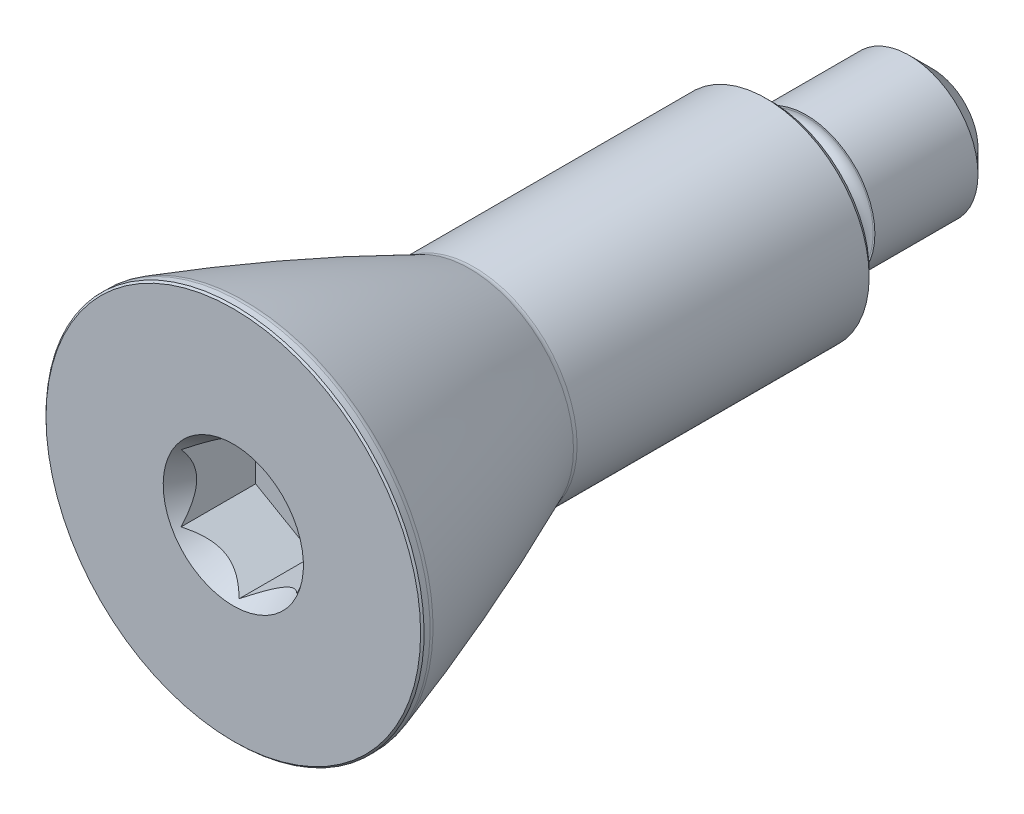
ISO-10303-21;
HEADER;
FILE_DESCRIPTION(('STEP AP214'),'2;1');
FILE_NAME('part.step','',(''),(''),'','','');
FILE_SCHEMA(('AUTOMOTIVE_DESIGN { 1 0 10303 214 1 1 1 1 }'));
ENDSEC;
DATA;
#1=APPLICATION_CONTEXT('core data for automotive mechanical design processes');
#2=APPLICATION_PROTOCOL_DEFINITION('international standard','automotive_design',2000,#1);
#3=PRODUCT_CONTEXT('',#1,'mechanical');
#4=PRODUCT('Part','Part','',(#3));
#5=PRODUCT_RELATED_PRODUCT_CATEGORY('part','',(#4));
#6=PRODUCT_DEFINITION_FORMATION('','',#4);
#7=PRODUCT_DEFINITION_CONTEXT('part definition',#1,'design');
#8=PRODUCT_DEFINITION('design','',#6,#7);
#9=PRODUCT_DEFINITION_SHAPE('','',#8);
#10=(LENGTH_UNIT() NAMED_UNIT(*) SI_UNIT(.MILLI.,.METRE.));
#11=(NAMED_UNIT(*) PLANE_ANGLE_UNIT() SI_UNIT($,.RADIAN.));
#12=(NAMED_UNIT(*) SI_UNIT($,.STERADIAN.) SOLID_ANGLE_UNIT());
#13=UNCERTAINTY_MEASURE_WITH_UNIT(LENGTH_MEASURE(1.E-05),#10,'distance_accuracy_value','');
#14=(GEOMETRIC_REPRESENTATION_CONTEXT(3) GLOBAL_UNCERTAINTY_ASSIGNED_CONTEXT((#13)) GLOBAL_UNIT_ASSIGNED_CONTEXT((#10,
#11,#12)) REPRESENTATION_CONTEXT('',''));
#15=CARTESIAN_POINT('',(0.,0.,0.));
#16=DIRECTION('',(0.,0.,1.));
#17=DIRECTION('',(1.,0.,0.));
#18=AXIS2_PLACEMENT_3D('',#15,#16,#17);
#19=CARTESIAN_POINT('',(0.,0.,47.));
#20=DIRECTION('',(0.,0.,-1.));
#21=DIRECTION('',(0.5,0.866025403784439,0.));
#22=AXIS2_PLACEMENT_3D('',#19,#20,#21);
#23=PLANE('',#22);
#24=CARTESIAN_POINT('',(0.,0.,47.));
#25=DIRECTION('',(0.,0.,-1.));
#26=DIRECTION('',(0.5,0.866025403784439,0.));
#27=AXIS2_PLACEMENT_3D('',#24,#25,#26);
#28=CIRCLE('',#27,16.35);
#29=CARTESIAN_POINT('',(8.175,14.1595153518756,47.));
#30=VERTEX_POINT('',#29);
#31=EDGE_CURVE('E22',#30,#30,#28,.F.);
#32=ORIENTED_EDGE('',*,*,#31,.T.);
#33=EDGE_LOOP('',(#32));
#34=FACE_BOUND('',#33,.T.);
#35=CARTESIAN_POINT('',(0.,0.,47.));
#36=DIRECTION('',(0.,0.,-1.));
#37=DIRECTION('',(0.5,0.866025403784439,0.));
#38=AXIS2_PLACEMENT_3D('',#35,#36,#37);
#39=CIRCLE('',#38,6.11991285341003);
#40=CARTESIAN_POINT('',(3.05995642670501,5.3,47.));
#41=VERTEX_POINT('',#40);
#42=EDGE_CURVE('E80',#41,#41,#39,.F.);
#43=ORIENTED_EDGE('',*,*,#42,.F.);
#44=EDGE_LOOP('',(#43));
#45=FACE_BOUND('',#44,.T.);
#46=ADVANCED_FACE('F14',(#34,#45),#23,.F.);
#47=CARTESIAN_POINT('',(0.,0.,-14.));
#48=DIRECTION('',(0.,0.,1.));
#49=DIRECTION('',(-0.5,-0.866025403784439,0.));
#50=AXIS2_PLACEMENT_3D('',#47,#48,#49);
#51=PLANE('',#50);
#52=CARTESIAN_POINT('',(0.,0.,-14.));
#53=DIRECTION('',(0.,0.,1.));
#54=DIRECTION('',(-0.5,-0.866025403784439,0.));
#55=AXIS2_PLACEMENT_3D('',#52,#53,#54);
#56=CIRCLE('',#55,4.);
#57=CARTESIAN_POINT('',(-2.,-3.46410161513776,-14.));
#58=VERTEX_POINT('',#57);
#59=EDGE_CURVE('E74',#58,#58,#56,.F.);
#60=ORIENTED_EDGE('',*,*,#59,.T.);
#61=EDGE_LOOP('',(#60));
#62=FACE_BOUND('',#61,.T.);
#63=ADVANCED_FACE('F204',(#62),#51,.F.);
#64=CARTESIAN_POINT('',(0.,0.,40.2674973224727));
#65=DIRECTION('',(0.,0.,1.));
#66=DIRECTION('',(-0.5,-0.866025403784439,0.));
#67=AXIS2_PLACEMENT_3D('',#64,#65,#66);
#68=CYLINDRICAL_SURFACE('',#67,6.);
#69=CARTESIAN_POINT('',(0.,0.,-12.));
#70=DIRECTION('',(0.,0.,1.));
#71=DIRECTION('',(-0.5,-0.866025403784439,0.));
#72=AXIS2_PLACEMENT_3D('',#69,#70,#71);
#73=CIRCLE('',#72,6.);
#74=CARTESIAN_POINT('',(-3.,-5.19615242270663,-12.));
#75=VERTEX_POINT('',#74);
#76=EDGE_CURVE('E130',#75,#75,#73,.T.);
#77=ORIENTED_EDGE('',*,*,#76,.T.);
#78=EDGE_LOOP('',(#77));
#79=FACE_BOUND('',#78,.T.);
#80=CARTESIAN_POINT('',(0.,0.,-3.));
#81=DIRECTION('',(0.,0.,1.));
#82=DIRECTION('',(-0.5,-0.866025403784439,0.));
#83=AXIS2_PLACEMENT_3D('',#80,#81,#82);
#84=CIRCLE('',#83,6.);
#85=CARTESIAN_POINT('',(-3.,-5.19615242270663,-3.));
#86=VERTEX_POINT('',#85);
#87=EDGE_CURVE('E121',#86,#86,#84,.T.);
#88=ORIENTED_EDGE('',*,*,#87,.F.);
#89=EDGE_LOOP('',(#88));
#90=FACE_BOUND('',#89,.T.);
#91=ADVANCED_FACE('F211',(#79,#90),#68,.T.);
#92=CARTESIAN_POINT('',(5.06624861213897,-2.925,-3.));
#93=DIRECTION('',(0.,0.,-1.));
#94=DIRECTION('',(0.5,0.866025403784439,0.));
#95=AXIS2_PLACEMENT_3D('',#92,#93,#94);
#96=PLANE('',#95);
#97=CARTESIAN_POINT('',(0.,0.,-3.));
#98=DIRECTION('',(0.,0.,1.));
#99=DIRECTION('',(-0.5,-0.866025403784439,0.));
#100=AXIS2_PLACEMENT_3D('',#97,#98,#99);
#101=CIRCLE('',#100,5.85);
#102=CARTESIAN_POINT('',(-2.925,-5.06624861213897,-3.));
#103=VERTEX_POINT('',#102);
#104=EDGE_CURVE('E118',#103,#103,#101,.T.);
#105=ORIENTED_EDGE('',*,*,#104,.F.);
#106=EDGE_LOOP('',(#105));
#107=FACE_BOUND('',#106,.T.);
#108=ORIENTED_EDGE('',*,*,#87,.T.);
#109=EDGE_LOOP('',(#108));
#110=FACE_BOUND('',#109,.T.);
#111=ADVANCED_FACE('F254',(#107,#110),#96,.F.);
#112=CARTESIAN_POINT('',(0.,0.,-2.));
#113=DIRECTION('',(0.,0.,1.));
#114=DIRECTION('',(-0.5,-0.866025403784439,0.));
#115=AXIS2_PLACEMENT_3D('',#112,#113,#114);
#116=TOROIDAL_SURFACE('',#115,5.85,1.);
#117=CARTESIAN_POINT('',(0.,0.,-2.));
#118=DIRECTION('',(0.,0.,1.));
#119=DIRECTION('',(-0.5,-0.866025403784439,0.));
#120=AXIS2_PLACEMENT_3D('',#117,#118,#119);
#121=CIRCLE('',#120,4.85);
#122=CARTESIAN_POINT('',(-2.425,-4.20022320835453,-2.));
#123=VERTEX_POINT('',#122);
#124=EDGE_CURVE('E115',#123,#123,#121,.T.);
#125=ORIENTED_EDGE('',*,*,#124,.F.);
#126=EDGE_LOOP('',(#125));
#127=FACE_BOUND('',#126,.T.);
#128=ORIENTED_EDGE('',*,*,#104,.T.);
#129=EDGE_LOOP('',(#128));
#130=FACE_BOUND('',#129,.T.);
#131=ADVANCED_FACE('F250',(#127,#130),#116,.F.);
#132=CARTESIAN_POINT('',(0.,0.,40.2674973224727));
#133=DIRECTION('',(0.,0.,1.));
#134=DIRECTION('',(-0.5,-0.866025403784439,0.));
#135=AXIS2_PLACEMENT_3D('',#132,#133,#134);
#136=CYLINDRICAL_SURFACE('',#135,4.85);
#137=CARTESIAN_POINT('',(0.,0.,-1.));
#138=DIRECTION('',(0.,0.,1.));
#139=DIRECTION('',(-0.5,-0.866025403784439,0.));
#140=AXIS2_PLACEMENT_3D('',#137,#138,#139);
#141=CIRCLE('',#140,4.85);
#142=CARTESIAN_POINT('',(-2.425,-4.20022320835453,-1.));
#143=VERTEX_POINT('',#142);
#144=EDGE_CURVE('E112',#143,#143,#141,.T.);
#145=ORIENTED_EDGE('',*,*,#144,.F.);
#146=EDGE_LOOP('',(#145));
#147=FACE_BOUND('',#146,.T.);
#148=ORIENTED_EDGE('',*,*,#124,.T.);
#149=EDGE_LOOP('',(#148));
#150=FACE_BOUND('',#149,.T.);
#151=ADVANCED_FACE('F246',(#147,#150),#136,.T.);
#152=CARTESIAN_POINT('',(0.,0.,-1.));
#153=DIRECTION('',(0.,0.,1.));
#154=DIRECTION('',(-0.5,-0.866025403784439,0.));
#155=AXIS2_PLACEMENT_3D('',#152,#153,#154);
#156=TOROIDAL_SURFACE('',#155,5.85,1.);
#157=CARTESIAN_POINT('',(0.,0.,0.));
#158=DIRECTION('',(0.,0.,1.));
#159=DIRECTION('',(-0.5,-0.866025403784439,0.));
#160=AXIS2_PLACEMENT_3D('',#157,#158,#159);
#161=CIRCLE('',#160,5.85);
#162=CARTESIAN_POINT('',(-2.925,-5.06624861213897,0.));
#163=VERTEX_POINT('',#162);
#164=EDGE_CURVE('E109',#163,#163,#161,.T.);
#165=ORIENTED_EDGE('',*,*,#164,.F.);
#166=EDGE_LOOP('',(#165));
#167=FACE_BOUND('',#166,.T.);
#168=ORIENTED_EDGE('',*,*,#144,.T.);
#169=EDGE_LOOP('',(#168));
#170=FACE_BOUND('',#169,.T.);
#171=ADVANCED_FACE('F242',(#167,#170),#156,.F.);
#172=CARTESIAN_POINT('',(5.06624861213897,-2.925,0.));
#173=DIRECTION('',(0.,0.,1.));
#174=DIRECTION('',(-0.5,-0.866025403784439,0.));
#175=AXIS2_PLACEMENT_3D('',#172,#173,#174);
#176=PLANE('',#175);
#177=CARTESIAN_POINT('',(0.,0.,0.));
#178=DIRECTION('',(0.,0.,1.));
#179=DIRECTION('',(-0.5,-0.866025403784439,0.));
#180=AXIS2_PLACEMENT_3D('',#177,#178,#179);
#181=CIRCLE('',#180,8.5);
#182=CARTESIAN_POINT('',(-4.25,-7.36121593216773,0.));
#183=VERTEX_POINT('',#182);
#184=EDGE_CURVE('E127',#183,#183,#181,.F.);
#185=ORIENTED_EDGE('',*,*,#184,.T.);
#186=EDGE_LOOP('',(#185));
#187=FACE_BOUND('',#186,.T.);
#188=ORIENTED_EDGE('',*,*,#164,.T.);
#189=EDGE_LOOP('',(#188));
#190=FACE_BOUND('',#189,.T.);
#191=ADVANCED_FACE('F238',(#187,#190),#176,.F.);
#192=CARTESIAN_POINT('',(0.,0.,40.2674973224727));
#193=DIRECTION('',(0.,0.,1.));
#194=DIRECTION('',(-0.5,-0.866025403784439,0.));
#195=AXIS2_PLACEMENT_3D('',#192,#193,#194);
#196=CYLINDRICAL_SURFACE('',#195,9.);
#197=CARTESIAN_POINT('',(0.,0.,0.5));
#198=DIRECTION('',(0.,0.,1.));
#199=DIRECTION('',(-0.5,-0.866025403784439,0.));
#200=AXIS2_PLACEMENT_3D('',#197,#198,#199);
#201=CIRCLE('',#200,9.);
#202=CARTESIAN_POINT('',(-4.5,-7.79422863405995,0.5));
#203=VERTEX_POINT('',#202);
#204=EDGE_CURVE('E124',#203,#203,#201,.T.);
#205=ORIENTED_EDGE('',*,*,#204,.T.);
#206=EDGE_LOOP('',(#205));
#207=FACE_BOUND('',#206,.T.);
#208=CARTESIAN_POINT('',(0.,0.,25.9919164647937));
#209=DIRECTION('',(0.,0.,1.));
#210=DIRECTION('',(-0.5,-0.866025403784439,0.));
#211=AXIS2_PLACEMENT_3D('',#208,#209,#210);
#212=CIRCLE('',#211,9.);
#213=CARTESIAN_POINT('',(-4.5,-7.79422863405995,25.9919164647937));
#214=VERTEX_POINT('',#213);
#215=EDGE_CURVE('E106',#214,#214,#212,.T.);
#216=ORIENTED_EDGE('',*,*,#215,.F.);
#217=EDGE_LOOP('',(#216));
#218=FACE_BOUND('',#217,.T.);
#219=ADVANCED_FACE('F234',(#207,#218),#196,.T.);
#220=CARTESIAN_POINT('',(0.,0.,25.9919164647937));
#221=DIRECTION('',(0.,0.,1.));
#222=DIRECTION('',(-0.5,-0.866025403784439,0.));
#223=AXIS2_PLACEMENT_3D('',#220,#221,#222);
#224=TOROIDAL_SURFACE('',#223,10.,0.999999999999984);
#225=CARTESIAN_POINT('',(0.,0.,26.3919767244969));
#226=DIRECTION('',(0.,0.,1.));
#227=DIRECTION('',(-0.5,-0.866025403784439,0.));
#228=AXIS2_PLACEMENT_3D('',#225,#226,#227);
#229=CIRCLE('',#228,9.08351116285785);
#230=CARTESIAN_POINT('',(-4.54175558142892,-7.86655142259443,26.3919767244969));
#231=VERTEX_POINT('',#230);
#232=EDGE_CURVE('E103',#231,#231,#229,.T.);
#233=ORIENTED_EDGE('',*,*,#232,.F.);
#234=EDGE_LOOP('',(#233));
#235=FACE_BOUND('',#234,.T.);
#236=ORIENTED_EDGE('',*,*,#215,.T.);
#237=EDGE_LOOP('',(#236));
#238=FACE_BOUND('',#237,.T.);
#239=ADVANCED_FACE('F230',(#235,#238),#224,.F.);
#240=CARTESIAN_POINT('',(0.,0.,106.404028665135));
#241=DIRECTION('',(0.,0.,1.));
#242=DIRECTION('',(-0.5,-0.866025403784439,0.));
#243=AXIS2_PLACEMENT_3D('',#240,#241,#242);
#244=DEGENERATE_TOROIDAL_SURFACE('',#243,174.214256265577,200.,.F.);
#245=CARTESIAN_POINT('',(0.,0.,46.0230009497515));
#246=DIRECTION('',(0.,0.,1.));
#247=DIRECTION('',(-0.5,-0.866025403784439,0.));
#248=AXIS2_PLACEMENT_3D('',#245,#246,#247);
#249=CIRCLE('',#248,16.4533379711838);
#250=CARTESIAN_POINT('',(-8.2266689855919,-14.2490086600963,46.0230009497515));
#251=VERTEX_POINT('',#250);
#252=EDGE_CURVE('E100',#251,#251,#249,.T.);
#253=ORIENTED_EDGE('',*,*,#252,.F.);
#254=EDGE_LOOP('',(#253));
#255=FACE_BOUND('',#254,.T.);
#256=ORIENTED_EDGE('',*,*,#232,.T.);
#257=EDGE_LOOP('',(#256));
#258=FACE_BOUND('',#257,.T.);
#259=ADVANCED_FACE('F226',(#255,#258),#244,.F.);
#260=CARTESIAN_POINT('',(0.,0.,46.3249060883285));
#261=DIRECTION('',(0.,0.,1.));
#262=DIRECTION('',(-0.5,-0.866025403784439,0.));
#263=AXIS2_PLACEMENT_3D('',#260,#261,#262);
#264=TOROIDAL_SURFACE('',#263,15.5,0.999999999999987);
#265=CARTESIAN_POINT('',(0.,0.,46.3249060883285));
#266=DIRECTION('',(0.,0.,1.));
#267=DIRECTION('',(-0.5,-0.866025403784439,0.));
#268=AXIS2_PLACEMENT_3D('',#265,#266,#267);
#269=CIRCLE('',#268,16.5);
#270=CARTESIAN_POINT('',(-8.25,-14.2894191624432,46.3249060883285));
#271=VERTEX_POINT('',#270);
#272=EDGE_CURVE('E97',#271,#271,#269,.T.);
#273=ORIENTED_EDGE('',*,*,#272,.F.);
#274=EDGE_LOOP('',(#273));
#275=FACE_BOUND('',#274,.T.);
#276=ORIENTED_EDGE('',*,*,#252,.T.);
#277=EDGE_LOOP('',(#276));
#278=FACE_BOUND('',#277,.T.);
#279=ADVANCED_FACE('F222',(#275,#278),#264,.T.);
#280=CARTESIAN_POINT('',(0.,0.,40.2674973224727));
#281=DIRECTION('',(0.,0.,1.));
#282=DIRECTION('',(-0.5,-0.866025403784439,0.));
#283=AXIS2_PLACEMENT_3D('',#280,#281,#282);
#284=CYLINDRICAL_SURFACE('',#283,16.5);
#285=CARTESIAN_POINT('',(0.,0.,46.85));
#286=DIRECTION('',(0.,0.,-1.));
#287=DIRECTION('',(0.5,0.866025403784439,0.));
#288=AXIS2_PLACEMENT_3D('',#285,#286,#287);
#289=CIRCLE('',#288,16.5);
#290=CARTESIAN_POINT('',(8.25,14.2894191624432,46.85));
#291=VERTEX_POINT('',#290);
#292=EDGE_CURVE('E9',#291,#291,#289,.T.);
#293=ORIENTED_EDGE('',*,*,#292,.T.);
#294=EDGE_LOOP('',(#293));
#295=FACE_BOUND('',#294,.T.);
#296=ORIENTED_EDGE('',*,*,#272,.T.);
#297=EDGE_LOOP('',(#296));
#298=FACE_BOUND('',#297,.T.);
#299=ADVANCED_FACE('F218',(#295,#298),#284,.T.);
#300=CARTESIAN_POINT('',(0.,0.,0.5));
#301=DIRECTION('',(0.,0.,1.));
#302=DIRECTION('',(-0.5,-0.866025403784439,0.));
#303=AXIS2_PLACEMENT_3D('',#300,#301,#302);
#304=CONICAL_SURFACE('',#303,9.,0.785398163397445);
#305=ORIENTED_EDGE('',*,*,#184,.F.);
#306=EDGE_LOOP('',(#305));
#307=FACE_BOUND('',#306,.T.);
#308=ORIENTED_EDGE('',*,*,#204,.F.);
#309=EDGE_LOOP('',(#308));
#310=FACE_BOUND('',#309,.T.);
#311=ADVANCED_FACE('F221',(#307,#310),#304,.T.);
#312=CARTESIAN_POINT('',(0.,0.,-12.));
#313=DIRECTION('',(0.,0.,1.));
#314=DIRECTION('',(-0.5,-0.866025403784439,0.));
#315=AXIS2_PLACEMENT_3D('',#312,#313,#314);
#316=CONICAL_SURFACE('',#315,6.,0.785398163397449);
#317=ORIENTED_EDGE('',*,*,#59,.F.);
#318=EDGE_LOOP('',(#317));
#319=FACE_BOUND('',#318,.T.);
#320=ORIENTED_EDGE('',*,*,#76,.F.);
#321=EDGE_LOOP('',(#320));
#322=FACE_BOUND('',#321,.T.);
#323=ADVANCED_FACE('F147',(#319,#322),#316,.T.);
#324=CARTESIAN_POINT('',(0.,0.,36.4));
#325=DIRECTION('',(0.,0.,1.));
#326=DIRECTION('',(-0.5,-0.866025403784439,0.));
#327=AXIS2_PLACEMENT_3D('',#324,#325,#326);
#328=CONICAL_SURFACE('',#327,0.,0.523598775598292);
#329=CARTESIAN_POINT('',(5.05,2.91584979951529,46.5002000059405));
#330=CARTESIAN_POINT('',(5.05,2.85485979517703,46.4473833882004));
#331=CARTESIAN_POINT('',(5.05,2.79326123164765,46.395271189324));
#332=CARTESIAN_POINT('',(5.05,2.66871303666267,46.2926519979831));
#333=CARTESIAN_POINT('',(5.05,2.60576302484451,46.2421454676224));
#334=CARTESIAN_POINT('',(5.05,2.41408893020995,46.0928687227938));
#335=CARTESIAN_POINT('',(5.05,2.28315969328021,45.9968838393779));
#336=CARTESIAN_POINT('',(5.05,2.01110881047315,45.812382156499));
#337=CARTESIAN_POINT('',(5.05,1.86981122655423,45.7241223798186));
#338=CARTESIAN_POINT('',(5.05,1.57956165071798,45.5616699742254));
#339=CARTESIAN_POINT('',(5.05,1.43062753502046,45.4874462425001));
#340=CARTESIAN_POINT('',(5.05,1.19457676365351,45.3871598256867));
#341=CARTESIAN_POINT('',(5.05,1.11022335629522,45.3545650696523));
#342=CARTESIAN_POINT('',(5.05,0.939307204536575,45.2956933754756));
#343=CARTESIAN_POINT('',(5.05,0.852744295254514,45.2694169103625));
#344=CARTESIAN_POINT('',(5.05,0.678442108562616,45.2241862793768));
#345=CARTESIAN_POINT('',(5.05,0.590717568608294,45.2051757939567));
#346=CARTESIAN_POINT('',(5.05,0.413948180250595,45.1748714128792));
#347=CARTESIAN_POINT('',(5.05,0.324903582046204,45.163576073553));
#348=CARTESIAN_POINT('',(5.05,0.145323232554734,45.1490861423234));
#349=CARTESIAN_POINT('',(5.05,0.0547813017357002,45.1459671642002));
#350=CARTESIAN_POINT('',(5.05,-0.126196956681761,45.1481833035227));
#351=CARTESIAN_POINT('',(5.05,-0.216633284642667,45.1535183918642));
#352=CARTESIAN_POINT('',(5.05,-0.396830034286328,45.1724341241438));
#353=CARTESIAN_POINT('',(5.05,-0.48658855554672,45.1860326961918));
#354=CARTESIAN_POINT('',(5.05,-0.664626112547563,45.2209513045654));
#355=CARTESIAN_POINT('',(5.05,-0.75290422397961,45.2422759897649));
#356=CARTESIAN_POINT('',(5.05,-0.952657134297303,45.2990591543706));
#357=CARTESIAN_POINT('',(5.05,-1.06347700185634,45.3368203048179));
#358=CARTESIAN_POINT('',(5.05,-1.28129641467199,45.4221297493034));
#359=CARTESIAN_POINT('',(5.05,-1.38829355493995,45.4696840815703));
#360=CARTESIAN_POINT('',(5.05,-1.59872786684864,45.5730374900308));
#361=CARTESIAN_POINT('',(5.05,-1.70214892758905,45.6288690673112));
#362=CARTESIAN_POINT('',(5.05,-1.90510068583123,45.7471032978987));
#363=CARTESIAN_POINT('',(5.05,-2.00463201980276,45.8095048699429));
#364=CARTESIAN_POINT('',(5.05,-2.24566931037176,45.9699530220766));
#365=CARTESIAN_POINT('',(5.05,-2.38513397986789,46.0710647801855));
#366=CARTESIAN_POINT('',(5.05,-2.58857118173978,46.228467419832));
#367=CARTESIAN_POINT('',(5.05,-2.65506355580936,46.2815746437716));
#368=CARTESIAN_POINT('',(5.05,-2.7865450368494,46.3895932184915));
#369=CARTESIAN_POINT('',(5.05,-2.85153445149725,46.4445041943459));
#370=CARTESIAN_POINT('',(5.05,-2.91584979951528,46.5002000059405));
#371=B_SPLINE_CURVE_WITH_KNOTS('',3,(#329,#330,#331,#332,#333,#334,#335,#336,#337,#338,#339,
#340,#341,#342,#343,#344,#345,#346,#347,#348,#349,#350,#351,#352,#353,#354,#355,#356,#357,#358,
#359,#360,#361,#362,#363,#364,#365,#366,#367,#368,#369,#370),.UNSPECIFIED.,.F.,.F.,(4,2,2,2,2,2,
2,2,2,2,2,2,2,2,2,2,2,2,2,2,4),(0.,0.242031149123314,0.484131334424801,0.970797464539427,
1.47003739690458,1.96815774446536,2.23924802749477,2.5103585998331,2.77932295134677,
3.04823696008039,3.31962921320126,3.59102053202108,3.86300276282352,4.13514892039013,
4.48580522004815,4.83667837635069,5.18896765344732,5.54119904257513,6.05748446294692,
6.31275614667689,6.56797510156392),.UNSPECIFIED.);
#372=CARTESIAN_POINT('',(5.05000000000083,2.91561885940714,46.5));
#373=VERTEX_POINT('',#372);
#374=CARTESIAN_POINT('',(5.05,-2.91561885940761,46.5));
#375=VERTEX_POINT('',#374);
#376=EDGE_CURVE('E70',#373,#375,#371,.T.);
#377=ORIENTED_EDGE('',*,*,#376,.T.);
#378=CARTESIAN_POINT('',(5.0502,-2.91550338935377,46.5002000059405));
#379=CARTESIAN_POINT('',(4.99738110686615,-2.9459983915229,46.4473833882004));
#380=CARTESIAN_POINT('',(4.94403518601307,-2.97679767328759,46.395271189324));
#381=CARTESIAN_POINT('',(4.83617328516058,-3.03907177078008,46.2926519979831));
#382=CARTESIAN_POINT('',(4.78165697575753,-3.07054677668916,46.2421454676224));
#383=CARTESIAN_POINT('',(4.61566234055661,-3.16638382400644,46.0928687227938));
#384=CARTESIAN_POINT('',(4.50227429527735,-3.23184844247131,45.9968838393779));
#385=CARTESIAN_POINT('',(4.26667131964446,-3.36787388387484,45.812382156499));
#386=CARTESIAN_POINT('',(4.14430402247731,-3.4385226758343,45.7241223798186));
#387=CARTESIAN_POINT('',(3.89294051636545,-3.58364746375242,45.5616699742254));
#388=CARTESIAN_POINT('',(3.76395978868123,-3.65811452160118,45.4874462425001));
#389=CARTESIAN_POINT('',(3.55953382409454,-3.77613990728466,45.3871598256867));
#390=CARTESIAN_POINT('',(3.48648163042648,-3.8183166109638,45.3545650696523));
#391=CARTESIAN_POINT('',(3.33846390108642,-3.90377468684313,45.2956933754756));
#392=CARTESIAN_POINT('',(3.26349822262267,-3.94705614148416,45.2694169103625));
#393=CARTESIAN_POINT('',(3.11254810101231,-4.03420723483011,45.2241862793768));
#394=CARTESIAN_POINT('',(3.03657642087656,-4.07806950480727,45.2051757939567));
#395=CARTESIAN_POINT('',(2.88348963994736,-4.16645419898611,45.1748714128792));
#396=CARTESIAN_POINT('',(2.80637475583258,-4.21097649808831,45.163576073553));
#397=CARTESIAN_POINT('',(2.65085361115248,-4.30076667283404,45.1490861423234));
#398=CARTESIAN_POINT('',(2.5724419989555,-4.34603763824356,45.1459671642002));
#399=CARTESIAN_POINT('',(2.41571022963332,-4.43652676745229,45.1481833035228));
#400=CARTESIAN_POINT('',(2.33739007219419,-4.48174493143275,45.1535183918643));
#401=CARTESIAN_POINT('',(2.1813351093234,-4.57184330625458,45.1724341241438));
#402=CARTESIAN_POINT('',(2.10360194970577,-4.61672256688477,45.1860326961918));
#403=CARTESIAN_POINT('',(1.94941690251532,-4.70574134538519,45.2209513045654));
#404=CARTESIAN_POINT('',(1.87296581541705,-4.74988040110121,45.2422759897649));
#405=CARTESIAN_POINT('',(1.69997472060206,-4.84975685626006,45.2990591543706));
#406=CARTESIAN_POINT('',(1.6040019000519,-4.90516679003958,45.3368203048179));
#407=CARTESIAN_POINT('',(1.41536475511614,-5.01407649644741,45.4221297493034));
#408=CARTESIAN_POINT('',(1.3227025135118,-5.06757506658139,45.4696840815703));
#409=CARTESIAN_POINT('',(1.14046105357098,-5.17279222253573,45.5730374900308));
#410=CARTESIAN_POINT('',(1.05089578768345,-5.22450275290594,45.6288690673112));
#411=CARTESIAN_POINT('',(0.875134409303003,-5.32597863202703,45.7471032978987));
#412=CARTESIAN_POINT('',(0.788937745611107,-5.37574429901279,45.8095048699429));
#413=CARTESIAN_POINT('',(0.580193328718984,-5.49626294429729,45.9699530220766));
#414=CARTESIAN_POINT('',(0.45941338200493,-5.56599527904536,46.0710647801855));
#415=CARTESIAN_POINT('',(0.28323159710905,-5.6677138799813,46.228467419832));
#416=CARTESIAN_POINT('',(0.225647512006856,-5.70096006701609,46.2815746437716));
#417=CARTESIAN_POINT('',(0.111781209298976,-5.76670080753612,46.3895932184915));
#418=CARTESIAN_POINT('',(0.0554987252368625,-5.79919551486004,46.4445041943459));
#419=CARTESIAN_POINT('',(-0.000199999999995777,-5.83135318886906,46.5002000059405));
#420=B_SPLINE_CURVE_WITH_KNOTS('',3,(#378,#379,#380,#381,#382,#383,#384,#385,#386,#387,#388,
#389,#390,#391,#392,#393,#394,#395,#396,#397,#398,#399,#400,#401,#402,#403,#404,#405,#406,#407,
#408,#409,#410,#411,#412,#413,#414,#415,#416,#417,#418,#419),.UNSPECIFIED.,.F.,.F.,(4,2,2,2,2,2,
2,2,2,2,2,2,2,2,2,2,2,2,2,2,4),(0.,0.242031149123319,0.484131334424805,0.970797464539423,
1.47003739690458,1.96815774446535,2.23924802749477,2.51035859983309,2.77932295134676,
3.04823696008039,3.31962921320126,3.59102053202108,3.86300276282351,4.13514892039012,
4.48580522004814,4.83667837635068,5.18896765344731,5.54119904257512,6.0574844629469,
6.31275614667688,6.56797510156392),.UNSPECIFIED.);
#421=CARTESIAN_POINT('',(8.27029417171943E-13,-5.8312377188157,46.5));
#422=VERTEX_POINT('',#421);
#423=EDGE_CURVE('E81',#375,#422,#420,.T.);
#424=ORIENTED_EDGE('',*,*,#423,.T.);
#425=CARTESIAN_POINT('',(-13.1568959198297,1.76489968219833,59.3925279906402));
#426=CARTESIAN_POINT('',(-13.0032788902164,1.67620884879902,59.1083997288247));
#427=CARTESIAN_POINT('',(-12.8493198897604,1.58732057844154,58.8245177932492));
#428=CARTESIAN_POINT('',(-12.540613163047,1.40908866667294,58.2573239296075));
#429=CARTESIAN_POINT('',(-12.3858654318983,1.31974502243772,57.9740120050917));
#430=CARTESIAN_POINT('',(-11.9199960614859,1.05077521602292,57.1245260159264));
#431=CARTESIAN_POINT('',(-11.6075336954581,0.870374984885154,56.5593307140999));
#432=CARTESIAN_POINT('',(-10.9689221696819,0.501672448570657,55.4163828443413));
#433=CARTESIAN_POINT('',(-10.6426367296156,0.313291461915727,54.838731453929));
#434=CARTESIAN_POINT('',(-10.1481595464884,0.0278049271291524,53.9764605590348));
#435=CARTESIAN_POINT('',(-9.98256276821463,-0.0678024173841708,53.6898571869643));
#436=CARTESIAN_POINT('',(-9.64929508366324,-0.260214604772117,53.1182641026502));
#437=CARTESIAN_POINT('',(-9.481624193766,-0.357019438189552,52.8332743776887));
#438=CARTESIAN_POINT('',(-9.14397379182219,-0.551961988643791,52.2656024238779));
#439=CARTESIAN_POINT('',(-8.97399715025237,-0.650098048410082,51.9829179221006));
#440=CARTESIAN_POINT('',(-8.63098751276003,-0.848134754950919,51.4200322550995));
#441=CARTESIAN_POINT('',(-8.45795454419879,-0.94803538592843,51.1398310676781));
#442=CARTESIAN_POINT('',(-8.10761911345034,-1.15030164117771,50.5818519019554));
#443=CARTESIAN_POINT('',(-7.93030645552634,-1.25267315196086,50.3040824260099));
#444=CARTESIAN_POINT('',(-7.66071868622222,-1.40831972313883,49.8906144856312));
#445=CARTESIAN_POINT('',(-7.57026166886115,-1.46054510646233,49.7533356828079));
#446=CARTESIAN_POINT('',(-7.3879543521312,-1.5658002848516,49.4799951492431));
#447=CARTESIAN_POINT('',(-7.29610389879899,-1.61883016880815,49.3439335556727));
#448=CARTESIAN_POINT('',(-7.02045926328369,-1.77797367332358,48.9411829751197));
#449=CARTESIAN_POINT('',(-6.83438371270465,-1.88540444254,48.6765506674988));
#450=CARTESIAN_POINT('',(-6.54921479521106,-2.05004679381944,48.2855262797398));
#451=CARTESIAN_POINT('',(-6.45315560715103,-2.10550659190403,48.1561803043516));
#452=CARTESIAN_POINT('',(-6.25867361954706,-2.21779081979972,47.8998836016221));
#453=CARTESIAN_POINT('',(-6.16025094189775,-2.27461517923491,47.7729327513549));
#454=CARTESIAN_POINT('',(-5.96104066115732,-2.38962928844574,47.5224592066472));
#455=CARTESIAN_POINT('',(-5.8602641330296,-2.44781264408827,47.3989247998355));
#456=CARTESIAN_POINT('',(-5.65549216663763,-2.56603779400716,47.1554774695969));
#457=CARTESIAN_POINT('',(-5.55149710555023,-2.62607937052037,47.0355641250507));
#458=CARTESIAN_POINT('',(-5.33981284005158,-2.74829533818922,46.800443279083));
#459=CARTESIAN_POINT('',(-5.23212813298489,-2.81046713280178,46.685230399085));
#460=CARTESIAN_POINT('',(-5.01226411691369,-2.9374056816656,46.4606990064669));
#461=CARTESIAN_POINT('',(-4.90008643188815,-3.00217149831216,46.351378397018));
#462=CARTESIAN_POINT('',(-4.73961938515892,-3.09481719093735,46.2040356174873));
#463=CARTESIAN_POINT('',(-4.69357001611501,-3.12140380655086,46.1627499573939));
#464=CARTESIAN_POINT('',(-4.60056950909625,-3.17509767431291,46.0815520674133));
#465=CARTESIAN_POINT('',(-4.55361833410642,-3.20220494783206,46.04163989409));
#466=CARTESIAN_POINT('',(-4.4112846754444,-3.28438132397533,45.9241720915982));
#467=CARTESIAN_POINT('',(-4.3144568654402,-3.34028488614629,45.8489174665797));
#468=CARTESIAN_POINT('',(-4.11703337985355,-3.4542673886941,45.7065591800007));
#469=CARTESIAN_POINT('',(-4.01645846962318,-3.51233434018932,45.639417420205));
#470=CARTESIAN_POINT('',(-3.81087243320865,-3.63102949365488,45.5149898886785));
#471=CARTESIAN_POINT('',(-3.7058648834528,-3.69165563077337,45.4576963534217));
#472=CARTESIAN_POINT('',(-3.49918555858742,-3.81098199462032,45.3591495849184));
#473=CARTESIAN_POINT('',(-3.39782582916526,-3.86950206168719,45.3170333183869));
#474=CARTESIAN_POINT('',(-3.19157230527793,-3.98858258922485,45.2455393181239));
#475=CARTESIAN_POINT('',(-3.0866742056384,-4.04914553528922,45.2161777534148));
#476=CARTESIAN_POINT('',(-2.90489861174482,-4.15409372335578,45.1784988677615));
#477=CARTESIAN_POINT('',(-2.82857673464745,-4.198158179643,45.1665659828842));
#478=CARTESIAN_POINT('',(-2.67529095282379,-4.28665776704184,45.1506821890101));
#479=CARTESIAN_POINT('',(-2.59832698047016,-4.33109293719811,45.1467321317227));
#480=CARTESIAN_POINT('',(-2.44445151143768,-4.41993298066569,45.1469869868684));
#481=CARTESIAN_POINT('',(-2.36754000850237,-4.46433785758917,45.1511875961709));
#482=CARTESIAN_POINT('',(-2.21436189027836,-4.55277528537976,45.1675584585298));
#483=CARTESIAN_POINT('',(-2.13809528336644,-4.59680783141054,45.1797288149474));
#484=CARTESIAN_POINT('',(-1.98726714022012,-4.68388850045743,45.21145697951));
#485=CARTESIAN_POINT('',(-1.91269756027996,-4.72694126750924,45.2309642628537));
#486=CARTESIAN_POINT('',(-1.7651094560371,-4.81215129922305,45.2767079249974));
#487=CARTESIAN_POINT('',(-1.69209164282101,-4.85430815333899,45.302947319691));
#488=CARTESIAN_POINT('',(-1.4757101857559,-4.97923604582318,45.3906483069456));
#489=CARTESIAN_POINT('',(-1.33504977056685,-5.0604463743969,45.4610855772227));
#490=CARTESIAN_POINT('',(-1.06486113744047,-5.21643985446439,45.6179150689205));
#491=CARTESIAN_POINT('',(-0.935151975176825,-5.29132747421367,45.703905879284));
#492=CARTESIAN_POINT('',(-0.68253481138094,-5.43717606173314,45.8884621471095));
#493=CARTESIAN_POINT('',(-0.559633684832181,-5.50813306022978,45.9870399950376));
#494=CARTESIAN_POINT('',(-0.318594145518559,-5.64729730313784,46.1945163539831));
#495=CARTESIAN_POINT('',(-0.200519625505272,-5.71546765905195,46.3035127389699));
#496=CARTESIAN_POINT('',(-0.0273487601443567,-5.81544790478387,46.4722609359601));
#497=CARTESIAN_POINT('',(0.0297050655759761,-5.8483879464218,46.529371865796));
#498=CARTESIAN_POINT('',(0.142621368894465,-5.91358020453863,46.6451409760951));
#499=CARTESIAN_POINT('',(0.198483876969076,-5.94583243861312,46.7037991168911));
#500=CARTESIAN_POINT('',(0.375202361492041,-6.04786090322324,46.8933365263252));
#501=CARTESIAN_POINT('',(0.4939895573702,-6.11644272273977,47.0267915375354));
#502=CARTESIAN_POINT('',(0.72726098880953,-6.25112204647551,47.2986430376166));
#503=CARTESIAN_POINT('',(0.841744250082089,-6.31721898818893,47.437040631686));
#504=CARTESIAN_POINT('',(1.06720173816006,-6.44738692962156,47.7177735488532));
#505=CARTESIAN_POINT('',(1.17817332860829,-6.51145640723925,47.8601116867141));
#506=CARTESIAN_POINT('',(1.39710486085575,-6.63785658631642,48.1478496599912));
#507=CARTESIAN_POINT('',(1.5050645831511,-6.70018716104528,48.293249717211));
#508=CARTESIAN_POINT('',(1.82600395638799,-6.88548159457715,48.7343033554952));
#509=CARTESIAN_POINT('',(2.03514907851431,-7.00623158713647,49.0336759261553));
#510=CARTESIAN_POINT('',(2.44590375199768,-7.243380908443,49.638971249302));
#511=CARTESIAN_POINT('',(2.64751639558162,-7.35978202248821,49.944891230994));
#512=CARTESIAN_POINT('',(3.02603657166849,-7.57832074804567,50.5319538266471));
#513=CARTESIAN_POINT('',(3.20345788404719,-7.68075499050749,50.8126560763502));
#514=CARTESIAN_POINT('',(3.55467901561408,-7.88353260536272,51.3771106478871));
#515=CARTESIAN_POINT('',(3.72847838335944,-7.98387571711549,51.6608633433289));
#516=CARTESIAN_POINT('',(4.07164323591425,-8.18200203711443,52.2282424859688));
#517=CARTESIAN_POINT('',(4.24103416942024,-8.2797999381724,52.5118484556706));
#518=CARTESIAN_POINT('',(4.57739594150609,-8.47399849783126,53.0808857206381));
#519=CARTESIAN_POINT('',(4.74436725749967,-8.5703994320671,53.3663166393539));
#520=CARTESIAN_POINT('',(4.91039253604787,-8.66625417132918,53.6524707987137));
#521=B_SPLINE_CURVE_WITH_KNOTS('',3,(#425,#426,#427,#428,#429,#430,#431,#432,#433,#434,#435,
#436,#437,#438,#439,#440,#441,#442,#443,#444,#445,#446,#447,#448,#449,#450,#451,#452,#453,#454,
#455,#456,#457,#458,#459,#460,#461,#462,#463,#464,#465,#466,#467,#468,#469,#470,#471,#472,#473,
#474,#475,#476,#477,#478,#479,#480,#481,#482,#483,#484,#485,#486,#487,#488,#489,#490,#491,#492,
#493,#494,#495,#496,#497,#498,#499,#500,#501,#502,#503,#504,#505,#506,#507,#508,#509,#510,#511,
#512,#513,#514,#515,#516,#517,#518,#519,#520),.UNSPECIFIED.,.F.,.F.,(4,2,2,2,2,2,2,2,2,2,2,2,2,
2,2,2,2,2,2,2,2,2,2,2,2,2,2,2,2,2,2,2,2,2,2,2,2,2,2,2,2,2,2,2,2,2,2,4),(0.,1.00485702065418,
2.00972028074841,4.02131655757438,6.09024125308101,7.12383765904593,8.15742590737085,
9.18982790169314,10.2222206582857,11.2573790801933,11.7748606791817,12.2923998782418,
13.3148271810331,13.8259749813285,14.3370964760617,14.8461669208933,15.3551779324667,
15.8635891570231,16.3718182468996,16.5737572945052,16.7757046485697,17.1797538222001,
17.5818250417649,17.9835778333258,18.3561379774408,18.7291690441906,18.9956385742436,
19.2621365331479,19.5284938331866,19.7948545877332,20.0594137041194,20.3240915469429,
20.8535564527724,21.3709213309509,21.8887994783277,22.4121389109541,22.6736854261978,
22.935225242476,23.509163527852,24.0832309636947,24.6577196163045,25.2322500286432,
26.3859103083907,27.5390916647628,28.5815800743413,29.6241976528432,30.6577231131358,
31.6910417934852),.UNSPECIFIED.);
#522=CARTESIAN_POINT('',(-5.05,-2.91561885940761,46.5));
#523=VERTEX_POINT('',#522);
#524=EDGE_CURVE('E167',#422,#523,#521,.F.);
#525=ORIENTED_EDGE('',*,*,#524,.T.);
#526=CARTESIAN_POINT('',(-5.05,-2.91584979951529,46.5002000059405));
#527=CARTESIAN_POINT('',(-5.05,-2.85485979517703,46.4473833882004));
#528=CARTESIAN_POINT('',(-5.05,-2.79326123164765,46.395271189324));
#529=CARTESIAN_POINT('',(-5.05,-2.66871303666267,46.2926519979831));
#530=CARTESIAN_POINT('',(-5.05,-2.60576302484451,46.2421454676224));
#531=CARTESIAN_POINT('',(-5.05,-2.41408893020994,46.0928687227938));
#532=CARTESIAN_POINT('',(-5.05,-2.28315969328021,45.9968838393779));
#533=CARTESIAN_POINT('',(-5.05,-2.01110881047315,45.812382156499));
#534=CARTESIAN_POINT('',(-5.05,-1.86981122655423,45.7241223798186));
#535=CARTESIAN_POINT('',(-5.05,-1.57956165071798,45.5616699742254));
#536=CARTESIAN_POINT('',(-5.05,-1.43062753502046,45.4874462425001));
#537=CARTESIAN_POINT('',(-5.05,-1.19457676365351,45.3871598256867));
#538=CARTESIAN_POINT('',(-5.05,-1.11022335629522,45.3545650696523));
#539=CARTESIAN_POINT('',(-5.05,-0.939307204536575,45.2956933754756));
#540=CARTESIAN_POINT('',(-5.05,-0.852744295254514,45.2694169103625));
#541=CARTESIAN_POINT('',(-5.05,-0.678442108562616,45.2241862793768));
#542=CARTESIAN_POINT('',(-5.05,-0.590717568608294,45.2051757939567));
#543=CARTESIAN_POINT('',(-5.05,-0.413948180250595,45.1748714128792));
#544=CARTESIAN_POINT('',(-5.05,-0.324903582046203,45.163576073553));
#545=CARTESIAN_POINT('',(-5.05,-0.145323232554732,45.1490861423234));
#546=CARTESIAN_POINT('',(-5.05,-0.0547813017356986,45.1459671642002));
#547=CARTESIAN_POINT('',(-5.05,0.126196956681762,45.1481833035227));
#548=CARTESIAN_POINT('',(-5.05,0.216633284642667,45.1535183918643));
#549=CARTESIAN_POINT('',(-5.05,0.396830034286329,45.1724341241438));
#550=CARTESIAN_POINT('',(-5.05,0.486588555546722,45.1860326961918));
#551=CARTESIAN_POINT('',(-5.05,0.664626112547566,45.2209513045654));
#552=CARTESIAN_POINT('',(-5.05,0.752904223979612,45.2422759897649));
#553=CARTESIAN_POINT('',(-5.05,0.952657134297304,45.2990591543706));
#554=CARTESIAN_POINT('',(-5.05,1.06347700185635,45.3368203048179));
#555=CARTESIAN_POINT('',(-5.05,1.28129641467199,45.4221297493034));
#556=CARTESIAN_POINT('',(-5.05,1.38829355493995,45.4696840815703));
#557=CARTESIAN_POINT('',(-5.05,1.59872786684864,45.5730374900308));
#558=CARTESIAN_POINT('',(-5.05,1.70214892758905,45.6288690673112));
#559=CARTESIAN_POINT('',(-5.05,1.90510068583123,45.7471032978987));
#560=CARTESIAN_POINT('',(-5.05,2.00463201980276,45.8095048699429));
#561=CARTESIAN_POINT('',(-5.05,2.24566931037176,45.9699530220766));
#562=CARTESIAN_POINT('',(-5.05,2.38513397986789,46.0710647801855));
#563=CARTESIAN_POINT('',(-5.05,2.58857118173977,46.228467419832));
#564=CARTESIAN_POINT('',(-5.05,2.65506355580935,46.2815746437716));
#565=CARTESIAN_POINT('',(-5.05,2.7865450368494,46.3895932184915));
#566=CARTESIAN_POINT('',(-5.05,2.85153445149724,46.4445041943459));
#567=CARTESIAN_POINT('',(-5.05,2.91584979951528,46.5002000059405));
#568=B_SPLINE_CURVE_WITH_KNOTS('',3,(#526,#527,#528,#529,#530,#531,#532,#533,#534,#535,#536,
#537,#538,#539,#540,#541,#542,#543,#544,#545,#546,#547,#548,#549,#550,#551,#552,#553,#554,#555,
#556,#557,#558,#559,#560,#561,#562,#563,#564,#565,#566,#567),.UNSPECIFIED.,.F.,.F.,(4,2,2,2,2,2,
2,2,2,2,2,2,2,2,2,2,2,2,2,2,4),(0.,0.242031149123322,0.484131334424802,0.970797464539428,
1.47003739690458,1.96815774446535,2.23924802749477,2.5103585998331,2.77932295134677,
3.04823696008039,3.31962921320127,3.59102053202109,3.86300276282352,4.13514892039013,
4.48580522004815,4.83667837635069,5.18896765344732,5.54119904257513,6.05748446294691,
6.31275614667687,6.56797510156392),.UNSPECIFIED.);
#569=CARTESIAN_POINT('',(-5.05,2.9156188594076,46.5));
#570=VERTEX_POINT('',#569);
#571=EDGE_CURVE('E160',#523,#570,#568,.T.);
#572=ORIENTED_EDGE('',*,*,#571,.T.);
#573=CARTESIAN_POINT('',(-5.0502,2.91550338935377,46.5002000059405));
#574=CARTESIAN_POINT('',(-4.99738110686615,2.9459983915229,46.4473833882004));
#575=CARTESIAN_POINT('',(-4.94403518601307,2.97679767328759,46.395271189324));
#576=CARTESIAN_POINT('',(-4.83617328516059,3.03907177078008,46.2926519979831));
#577=CARTESIAN_POINT('',(-4.78165697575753,3.07054677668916,46.2421454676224));
#578=CARTESIAN_POINT('',(-4.61566234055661,3.16638382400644,46.0928687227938));
#579=CARTESIAN_POINT('',(-4.50227429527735,3.23184844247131,45.9968838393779));
#580=CARTESIAN_POINT('',(-4.26667131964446,3.36787388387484,45.812382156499));
#581=CARTESIAN_POINT('',(-4.14430402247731,3.43852267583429,45.7241223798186));
#582=CARTESIAN_POINT('',(-3.89294051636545,3.58364746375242,45.5616699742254));
#583=CARTESIAN_POINT('',(-3.76395978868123,3.65811452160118,45.4874462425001));
#584=CARTESIAN_POINT('',(-3.55953382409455,3.77613990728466,45.3871598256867));
#585=CARTESIAN_POINT('',(-3.48648163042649,3.8183166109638,45.3545650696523));
#586=CARTESIAN_POINT('',(-3.33846390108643,3.90377468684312,45.2956933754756));
#587=CARTESIAN_POINT('',(-3.26349822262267,3.94705614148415,45.2694169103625));
#588=CARTESIAN_POINT('',(-3.11254810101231,4.0342072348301,45.2241862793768));
#589=CARTESIAN_POINT('',(-3.03657642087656,4.07806950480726,45.2051757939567));
#590=CARTESIAN_POINT('',(-2.88348963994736,4.16645419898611,45.1748714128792));
#591=CARTESIAN_POINT('',(-2.80637475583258,4.21097649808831,45.163576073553));
#592=CARTESIAN_POINT('',(-2.65085361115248,4.30076667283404,45.1490861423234));
#593=CARTESIAN_POINT('',(-2.5724419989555,4.34603763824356,45.1459671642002));
#594=CARTESIAN_POINT('',(-2.41571022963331,4.43652676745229,45.1481833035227));
#595=CARTESIAN_POINT('',(-2.33739007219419,4.48174493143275,45.1535183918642));
#596=CARTESIAN_POINT('',(-2.18133510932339,4.57184330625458,45.1724341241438));
#597=CARTESIAN_POINT('',(-2.10360194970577,4.61672256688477,45.1860326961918));
#598=CARTESIAN_POINT('',(-1.94941690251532,4.70574134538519,45.2209513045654));
#599=CARTESIAN_POINT('',(-1.87296581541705,4.74988040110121,45.2422759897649));
#600=CARTESIAN_POINT('',(-1.69997472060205,4.84975685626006,45.2990591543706));
#601=CARTESIAN_POINT('',(-1.6040019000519,4.90516679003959,45.3368203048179));
#602=CARTESIAN_POINT('',(-1.41536475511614,5.01407649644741,45.4221297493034));
#603=CARTESIAN_POINT('',(-1.3227025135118,5.06757506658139,45.4696840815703));
#604=CARTESIAN_POINT('',(-1.14046105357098,5.17279222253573,45.5730374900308));
#605=CARTESIAN_POINT('',(-1.05089578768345,5.22450275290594,45.6288690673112));
#606=CARTESIAN_POINT('',(-0.875134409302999,5.32597863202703,45.7471032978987));
#607=CARTESIAN_POINT('',(-0.788937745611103,5.37574429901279,45.8095048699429));
#608=CARTESIAN_POINT('',(-0.580193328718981,5.49626294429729,45.9699530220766));
#609=CARTESIAN_POINT('',(-0.459413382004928,5.56599527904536,46.0710647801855));
#610=CARTESIAN_POINT('',(-0.283231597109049,5.6677138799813,46.228467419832));
#611=CARTESIAN_POINT('',(-0.225647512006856,5.70096006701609,46.2815746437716));
#612=CARTESIAN_POINT('',(-0.111781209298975,5.76670080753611,46.3895932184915));
#613=CARTESIAN_POINT('',(-0.0554987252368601,5.79919551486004,46.4445041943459));
#614=CARTESIAN_POINT('',(0.000199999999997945,5.83135318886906,46.5002000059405));
#615=B_SPLINE_CURVE_WITH_KNOTS('',3,(#573,#574,#575,#576,#577,#578,#579,#580,#581,#582,#583,
#584,#585,#586,#587,#588,#589,#590,#591,#592,#593,#594,#595,#596,#597,#598,#599,#600,#601,#602,
#603,#604,#605,#606,#607,#608,#609,#610,#611,#612,#613,#614),.UNSPECIFIED.,.F.,.F.,(4,2,2,2,2,2,
2,2,2,2,2,2,2,2,2,2,2,2,2,2,4),(0.,0.242031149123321,0.484131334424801,0.970797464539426,
1.47003739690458,1.96815774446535,2.23924802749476,2.51035859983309,2.77932295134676,
3.04823696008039,3.31962921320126,3.59102053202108,3.86300276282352,4.13514892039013,
4.48580522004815,4.83667837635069,5.18896765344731,5.54119904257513,6.05748446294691,
6.31275614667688,6.56797510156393),.UNSPECIFIED.);
#616=CARTESIAN_POINT('',(0.,5.83123771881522,46.5));
#617=VERTEX_POINT('',#616);
#618=EDGE_CURVE('E29',#570,#617,#615,.T.);
#619=ORIENTED_EDGE('',*,*,#618,.T.);
#620=CARTESIAN_POINT('',(-8.10689591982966,10.5117562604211,59.3925279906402));
#621=CARTESIAN_POINT('',(-7.95327889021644,10.4230654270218,59.1083997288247));
#622=CARTESIAN_POINT('',(-7.79931988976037,10.3341771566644,58.8245177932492));
#623=CARTESIAN_POINT('',(-7.49061316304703,10.1559452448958,58.2573239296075));
#624=CARTESIAN_POINT('',(-7.33586543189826,10.0666016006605,57.9740120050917));
#625=CARTESIAN_POINT('',(-6.86999606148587,9.79763179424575,57.1245260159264));
#626=CARTESIAN_POINT('',(-6.55753369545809,9.61723156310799,56.5593307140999));
#627=CARTESIAN_POINT('',(-5.91892216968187,9.24852902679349,55.4163828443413));
#628=CARTESIAN_POINT('',(-5.59263672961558,9.06014804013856,54.838731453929));
#629=CARTESIAN_POINT('',(-5.09815954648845,8.77466150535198,53.9764605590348));
#630=CARTESIAN_POINT('',(-4.93256276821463,8.67905416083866,53.6898571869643));
#631=CARTESIAN_POINT('',(-4.59929508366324,8.48664197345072,53.1182641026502));
#632=CARTESIAN_POINT('',(-4.43162419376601,8.38983714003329,52.8332743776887));
#633=CARTESIAN_POINT('',(-4.09397379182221,8.19489458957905,52.2656024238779));
#634=CARTESIAN_POINT('',(-3.92399715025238,8.09675852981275,51.9829179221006));
#635=CARTESIAN_POINT('',(-3.58098751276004,7.89872182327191,51.4200322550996));
#636=CARTESIAN_POINT('',(-3.4079545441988,7.7988211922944,51.1398310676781));
#637=CARTESIAN_POINT('',(-3.05761911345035,7.59655493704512,50.5818519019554));
#638=CARTESIAN_POINT('',(-2.88030645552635,7.49418342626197,50.3040824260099));
#639=CARTESIAN_POINT('',(-2.61071868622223,7.33853685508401,49.8906144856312));
#640=CARTESIAN_POINT('',(-2.52026166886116,7.2863114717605,49.753335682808));
#641=CARTESIAN_POINT('',(-2.3379543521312,7.18105629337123,49.4799951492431));
#642=CARTESIAN_POINT('',(-2.24610389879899,7.12802640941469,49.3439335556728));
#643=CARTESIAN_POINT('',(-1.97045926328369,6.96888290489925,48.9411829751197));
#644=CARTESIAN_POINT('',(-1.78438371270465,6.86145213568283,48.6765506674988));
#645=CARTESIAN_POINT('',(-1.49921479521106,6.69680978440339,48.2855262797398));
#646=CARTESIAN_POINT('',(-1.40315560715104,6.6413499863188,48.1561803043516));
#647=CARTESIAN_POINT('',(-1.20867361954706,6.52906575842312,47.8998836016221));
#648=CARTESIAN_POINT('',(-1.11025094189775,6.47224139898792,47.7729327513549));
#649=CARTESIAN_POINT('',(-0.911040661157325,6.3572272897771,47.5224592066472));
#650=CARTESIAN_POINT('',(-0.810264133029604,6.29904393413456,47.3989247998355));
#651=CARTESIAN_POINT('',(-0.605492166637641,6.18081878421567,47.1554774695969));
#652=CARTESIAN_POINT('',(-0.501497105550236,6.12077720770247,47.0355641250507));
#653=CARTESIAN_POINT('',(-0.289812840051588,5.99856124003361,46.800443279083));
#654=CARTESIAN_POINT('',(-0.182128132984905,5.93638944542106,46.685230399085));
#655=CARTESIAN_POINT('',(0.0377358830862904,5.80945089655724,46.4606990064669));
#656=CARTESIAN_POINT('',(0.149913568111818,5.74468507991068,46.351378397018));
#657=CARTESIAN_POINT('',(0.310380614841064,5.65203938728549,46.2040356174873));
#658=CARTESIAN_POINT('',(0.35642998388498,5.62545277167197,46.1627499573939));
#659=CARTESIAN_POINT('',(0.449430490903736,5.57175890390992,46.0815520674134));
#660=CARTESIAN_POINT('',(0.496381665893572,5.54465163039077,46.04163989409));
#661=CARTESIAN_POINT('',(0.638715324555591,5.46247525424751,45.9241720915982));
#662=CARTESIAN_POINT('',(0.735543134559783,5.40657169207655,45.8489174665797));
#663=CARTESIAN_POINT('',(0.932966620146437,5.29258918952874,45.7065591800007));
#664=CARTESIAN_POINT('',(1.03354153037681,5.23452223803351,45.639417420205));
#665=CARTESIAN_POINT('',(1.23912756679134,5.11582708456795,45.5149898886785));
#666=CARTESIAN_POINT('',(1.34413511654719,5.05520094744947,45.4576963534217));
#667=CARTESIAN_POINT('',(1.55081444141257,4.93587458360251,45.3591495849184));
#668=CARTESIAN_POINT('',(1.65217417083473,4.87735451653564,45.3170333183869));
#669=CARTESIAN_POINT('',(1.85842769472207,4.75827398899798,45.2455393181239));
#670=CARTESIAN_POINT('',(1.9633257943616,4.69771104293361,45.2161777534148));
#671=CARTESIAN_POINT('',(2.14510138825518,4.59276285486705,45.1784988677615));
#672=CARTESIAN_POINT('',(2.22142326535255,4.54869839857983,45.1665659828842));
#673=CARTESIAN_POINT('',(2.37470904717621,4.46019881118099,45.1506821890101));
#674=CARTESIAN_POINT('',(2.45167301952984,4.41576364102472,45.1467321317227));
#675=CARTESIAN_POINT('',(2.60554848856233,4.32692359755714,45.1469869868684));
#676=CARTESIAN_POINT('',(2.68245999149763,4.28251872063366,45.1511875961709));
#677=CARTESIAN_POINT('',(2.83563810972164,4.19408129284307,45.1675584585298));
#678=CARTESIAN_POINT('',(2.91190471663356,4.15004874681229,45.1797288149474));
#679=CARTESIAN_POINT('',(3.06273285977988,4.06296807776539,45.21145697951));
#680=CARTESIAN_POINT('',(3.13730243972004,4.01991531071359,45.2309642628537));
#681=CARTESIAN_POINT('',(3.28489054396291,3.93470527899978,45.2767079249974));
#682=CARTESIAN_POINT('',(3.35790835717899,3.89254842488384,45.302947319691));
#683=CARTESIAN_POINT('',(3.5742898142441,3.76762053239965,45.3906483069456));
#684=CARTESIAN_POINT('',(3.71495022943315,3.68641020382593,45.4610855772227));
#685=CARTESIAN_POINT('',(3.98513886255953,3.53041672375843,45.6179150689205));
#686=CARTESIAN_POINT('',(4.11484802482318,3.45552910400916,45.703905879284));
#687=CARTESIAN_POINT('',(4.36746518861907,3.30968051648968,45.8884621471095));
#688=CARTESIAN_POINT('',(4.49036631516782,3.23872351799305,45.9870399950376));
#689=CARTESIAN_POINT('',(4.73140585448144,3.09955927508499,46.1945163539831));
#690=CARTESIAN_POINT('',(4.84948037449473,3.03138891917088,46.3035127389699));
#691=CARTESIAN_POINT('',(5.02265123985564,2.93140867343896,46.4722609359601));
#692=CARTESIAN_POINT('',(5.07970506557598,2.89846863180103,46.529371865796));
#693=CARTESIAN_POINT('',(5.19262136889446,2.8332763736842,46.6451409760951));
#694=CARTESIAN_POINT('',(5.24848387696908,2.80102413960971,46.7037991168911));
#695=CARTESIAN_POINT('',(5.42520236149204,2.69899567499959,46.8933365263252));
#696=CARTESIAN_POINT('',(5.5439895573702,2.63041385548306,47.0267915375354));
#697=CARTESIAN_POINT('',(5.77726098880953,2.49573453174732,47.2986430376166));
#698=CARTESIAN_POINT('',(5.89174425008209,2.4296375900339,47.437040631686));
#699=CARTESIAN_POINT('',(6.11720173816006,2.29946964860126,47.7177735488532));
#700=CARTESIAN_POINT('',(6.22817332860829,2.23540017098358,47.8601116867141));
#701=CARTESIAN_POINT('',(6.44710486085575,2.10899999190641,48.1478496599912));
#702=CARTESIAN_POINT('',(6.55506458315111,2.04666941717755,48.293249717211));
#703=CARTESIAN_POINT('',(6.876003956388,1.86137498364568,48.7343033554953));
#704=CARTESIAN_POINT('',(7.08514907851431,1.74062499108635,49.0336759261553));
#705=CARTESIAN_POINT('',(7.49590375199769,1.50347566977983,49.638971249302));
#706=CARTESIAN_POINT('',(7.69751639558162,1.38707455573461,49.9448912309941));
#707=CARTESIAN_POINT('',(8.0760365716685,1.16853583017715,50.5319538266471));
#708=CARTESIAN_POINT('',(8.25345788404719,1.06610158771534,50.8126560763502));
#709=CARTESIAN_POINT('',(8.60467901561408,0.863323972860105,51.3771106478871));
#710=CARTESIAN_POINT('',(8.77847838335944,0.762980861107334,51.6608633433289));
#711=CARTESIAN_POINT('',(9.12164323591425,0.564854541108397,52.2282424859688));
#712=CARTESIAN_POINT('',(9.29103416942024,0.467056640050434,52.5118484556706));
#713=CARTESIAN_POINT('',(9.6273959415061,0.272858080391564,53.0808857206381));
#714=CARTESIAN_POINT('',(9.79436725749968,0.176457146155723,53.366316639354));
#715=CARTESIAN_POINT('',(9.96039253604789,0.0806024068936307,53.6524707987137));
#716=B_SPLINE_CURVE_WITH_KNOTS('',3,(#620,#621,#622,#623,#624,#625,#626,#627,#628,#629,#630,
#631,#632,#633,#634,#635,#636,#637,#638,#639,#640,#641,#642,#643,#644,#645,#646,#647,#648,#649,
#650,#651,#652,#653,#654,#655,#656,#657,#658,#659,#660,#661,#662,#663,#664,#665,#666,#667,#668,
#669,#670,#671,#672,#673,#674,#675,#676,#677,#678,#679,#680,#681,#682,#683,#684,#685,#686,#687,
#688,#689,#690,#691,#692,#693,#694,#695,#696,#697,#698,#699,#700,#701,#702,#703,#704,#705,#706,
#707,#708,#709,#710,#711,#712,#713,#714,#715),.UNSPECIFIED.,.F.,.F.,(4,2,2,2,2,2,2,2,2,2,2,2,2,
2,2,2,2,2,2,2,2,2,2,2,2,2,2,2,2,2,2,2,2,2,2,2,2,2,2,2,2,2,2,2,2,2,2,4),(0.,1.00485702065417,
2.0097202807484,4.02131655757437,6.09024125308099,7.12383765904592,8.15742590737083,
9.18982790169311,10.2222206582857,11.2573790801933,11.7748606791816,12.2923998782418,
13.3148271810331,13.8259749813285,14.3370964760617,14.8461669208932,15.3551779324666,
15.863589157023,16.3718182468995,16.5737572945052,16.7757046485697,17.1797538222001,
17.5818250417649,17.9835778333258,18.3561379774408,18.7291690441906,18.9956385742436,
19.2621365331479,19.5284938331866,19.7948545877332,20.0594137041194,20.3240915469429,
20.8535564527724,21.3709213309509,21.8887994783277,22.4121389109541,22.6736854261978,
22.935225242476,23.509163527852,24.0832309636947,24.6577196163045,25.2322500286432,
26.3859103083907,27.5390916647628,28.5815800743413,29.6241976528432,30.6577231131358,
31.6910417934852),.UNSPECIFIED.);
#717=EDGE_CURVE('E66',#617,#373,#716,.T.);
#718=ORIENTED_EDGE('',*,*,#717,.T.);
#719=EDGE_LOOP('',(#377,#424,#525,#572,#619,#718));
#720=FACE_BOUND('',#719,.T.);
#721=ORIENTED_EDGE('',*,*,#42,.T.);
#722=EDGE_LOOP('',(#721));
#723=FACE_BOUND('',#722,.T.);
#724=ADVANCED_FACE('F68',(#720,#723),#328,.F.);
#725=CARTESIAN_POINT('',(5.05,2.91561885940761,40.));
#726=DIRECTION('',(0.,0.,1.));
#727=DIRECTION('',(-0.5,-0.866025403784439,0.));
#728=AXIS2_PLACEMENT_3D('',#725,#726,#727);
#729=PLANE('',#728);
#730=DIRECTION('',(0.,1.,0.));
#731=VECTOR('',#730,1.);
#732=CARTESIAN_POINT('',(5.05,-2.91561885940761,40.));
#733=LINE('',#732,#731);
#734=CARTESIAN_POINT('',(5.05,-2.91561885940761,40.));
#735=VERTEX_POINT('',#734);
#736=CARTESIAN_POINT('',(5.05,2.91561885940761,40.));
#737=VERTEX_POINT('',#736);
#738=EDGE_CURVE('E434',#735,#737,#733,.T.);
#739=ORIENTED_EDGE('',*,*,#738,.T.);
#740=DIRECTION('',(-0.866025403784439,0.5,0.));
#741=VECTOR('',#740,1.);
#742=CARTESIAN_POINT('',(5.05,2.91561885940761,40.));
#743=LINE('',#742,#741);
#744=CARTESIAN_POINT('',(0.,5.83123771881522,40.));
#745=VERTEX_POINT('',#744);
#746=EDGE_CURVE('E85',#737,#745,#743,.T.);
#747=ORIENTED_EDGE('',*,*,#746,.T.);
#748=DIRECTION('',(-0.866025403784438,-0.5,0.));
#749=VECTOR('',#748,1.);
#750=CARTESIAN_POINT('',(0.,5.83123771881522,40.));
#751=LINE('',#750,#749);
#752=CARTESIAN_POINT('',(-5.05,2.9156188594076,40.));
#753=VERTEX_POINT('',#752);
#754=EDGE_CURVE('E438',#745,#753,#751,.T.);
#755=ORIENTED_EDGE('',*,*,#754,.T.);
#756=DIRECTION('',(0.,-1.,0.));
#757=VECTOR('',#756,1.);
#758=CARTESIAN_POINT('',(-5.05,2.9156188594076,40.));
#759=LINE('',#758,#757);
#760=CARTESIAN_POINT('',(-5.05,-2.91561885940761,40.));
#761=VERTEX_POINT('',#760);
#762=EDGE_CURVE('E443',#753,#761,#759,.T.);
#763=ORIENTED_EDGE('',*,*,#762,.T.);
#764=DIRECTION('',(0.866025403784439,-0.5,0.));
#765=VECTOR('',#764,1.);
#766=CARTESIAN_POINT('',(-5.05,-2.91561885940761,40.));
#767=LINE('',#766,#765);
#768=CARTESIAN_POINT('',(0.,-5.83123771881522,40.));
#769=VERTEX_POINT('',#768);
#770=EDGE_CURVE('E93',#761,#769,#767,.T.);
#771=ORIENTED_EDGE('',*,*,#770,.T.);
#772=DIRECTION('',(0.866025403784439,0.5,0.));
#773=VECTOR('',#772,1.);
#774=CARTESIAN_POINT('',(0.,-5.83123771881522,40.));
#775=LINE('',#774,#773);
#776=EDGE_CURVE('E88',#769,#735,#775,.T.);
#777=ORIENTED_EDGE('',*,*,#776,.T.);
#778=EDGE_LOOP('',(#739,#747,#755,#763,#771,#777));
#779=FACE_BOUND('',#778,.T.);
#780=ADVANCED_FACE('F146',(#779),#729,.T.);
#781=CARTESIAN_POINT('',(5.05,2.91561885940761,40.));
#782=DIRECTION('',(0.5,0.866025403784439,0.));
#783=DIRECTION('',(-0.866025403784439,0.5,0.));
#784=AXIS2_PLACEMENT_3D('',#781,#782,#783);
#785=PLANE('',#784);
#786=ORIENTED_EDGE('',*,*,#717,.F.);
#787=DIRECTION('',(0.,0.,1.));
#788=VECTOR('',#787,1.);
#789=CARTESIAN_POINT('',(0.,5.83123771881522,40.));
#790=LINE('',#789,#788);
#791=EDGE_CURVE('E87',#745,#617,#790,.T.);
#792=ORIENTED_EDGE('',*,*,#791,.F.);
#793=ORIENTED_EDGE('',*,*,#746,.F.);
#794=DIRECTION('',(0.,0.,1.));
#795=VECTOR('',#794,1.);
#796=CARTESIAN_POINT('',(5.05,2.91561885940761,40.));
#797=LINE('',#796,#795);
#798=EDGE_CURVE('E78',#737,#373,#797,.T.);
#799=ORIENTED_EDGE('',*,*,#798,.T.);
#800=EDGE_LOOP('',(#786,#792,#793,#799));
#801=FACE_BOUND('',#800,.T.);
#802=ADVANCED_FACE('F83',(#801),#785,.F.);
#803=CARTESIAN_POINT('',(0.,5.83123771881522,40.));
#804=DIRECTION('',(-0.5,0.866025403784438,0.));
#805=DIRECTION('',(-0.866025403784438,-0.5,0.));
#806=AXIS2_PLACEMENT_3D('',#803,#804,#805);
#807=PLANE('',#806);
#808=ORIENTED_EDGE('',*,*,#618,.F.);
#809=DIRECTION('',(0.,0.,1.));
#810=VECTOR('',#809,1.);
#811=CARTESIAN_POINT('',(-5.05,2.9156188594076,40.));
#812=LINE('',#811,#810);
#813=EDGE_CURVE('E90',#753,#570,#812,.T.);
#814=ORIENTED_EDGE('',*,*,#813,.F.);
#815=ORIENTED_EDGE('',*,*,#754,.F.);
#816=ORIENTED_EDGE('',*,*,#791,.T.);
#817=EDGE_LOOP('',(#808,#814,#815,#816));
#818=FACE_BOUND('',#817,.T.);
#819=ADVANCED_FACE('F193',(#818),#807,.F.);
#820=CARTESIAN_POINT('',(-5.05,2.9156188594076,40.));
#821=DIRECTION('',(-1.,0.,0.));
#822=DIRECTION('',(0.,-1.,0.));
#823=AXIS2_PLACEMENT_3D('',#820,#821,#822);
#824=PLANE('',#823);
#825=ORIENTED_EDGE('',*,*,#571,.F.);
#826=DIRECTION('',(0.,0.,1.));
#827=VECTOR('',#826,1.);
#828=CARTESIAN_POINT('',(-5.05,-2.91561885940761,40.));
#829=LINE('',#828,#827);
#830=EDGE_CURVE('E451',#761,#523,#829,.T.);
#831=ORIENTED_EDGE('',*,*,#830,.F.);
#832=ORIENTED_EDGE('',*,*,#762,.F.);
#833=ORIENTED_EDGE('',*,*,#813,.T.);
#834=EDGE_LOOP('',(#825,#831,#832,#833));
#835=FACE_BOUND('',#834,.T.);
#836=ADVANCED_FACE('F189',(#835),#824,.F.);
#837=CARTESIAN_POINT('',(-5.05,-2.91561885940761,40.));
#838=DIRECTION('',(-0.5,-0.866025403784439,0.));
#839=DIRECTION('',(0.866025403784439,-0.5,0.));
#840=AXIS2_PLACEMENT_3D('',#837,#838,#839);
#841=PLANE('',#840);
#842=ORIENTED_EDGE('',*,*,#524,.F.);
#843=DIRECTION('',(0.,0.,1.));
#844=VECTOR('',#843,1.);
#845=CARTESIAN_POINT('',(0.,-5.83123771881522,40.));
#846=LINE('',#845,#844);
#847=EDGE_CURVE('E448',#769,#422,#846,.T.);
#848=ORIENTED_EDGE('',*,*,#847,.F.);
#849=ORIENTED_EDGE('',*,*,#770,.F.);
#850=ORIENTED_EDGE('',*,*,#830,.T.);
#851=EDGE_LOOP('',(#842,#848,#849,#850));
#852=FACE_BOUND('',#851,.T.);
#853=ADVANCED_FACE('F186',(#852),#841,.F.);
#854=CARTESIAN_POINT('',(0.,-5.83123771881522,40.));
#855=DIRECTION('',(0.5,-0.866025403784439,0.));
#856=DIRECTION('',(0.866025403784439,0.5,0.));
#857=AXIS2_PLACEMENT_3D('',#854,#855,#856);
#858=PLANE('',#857);
#859=ORIENTED_EDGE('',*,*,#423,.F.);
#860=DIRECTION('',(0.,0.,1.));
#861=VECTOR('',#860,1.);
#862=CARTESIAN_POINT('',(5.05,-2.91561885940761,40.));
#863=LINE('',#862,#861);
#864=EDGE_CURVE('E37',#735,#375,#863,.T.);
#865=ORIENTED_EDGE('',*,*,#864,.F.);
#866=ORIENTED_EDGE('',*,*,#776,.F.);
#867=ORIENTED_EDGE('',*,*,#847,.T.);
#868=EDGE_LOOP('',(#859,#865,#866,#867));
#869=FACE_BOUND('',#868,.T.);
#870=ADVANCED_FACE('F183',(#869),#858,.F.);
#871=CARTESIAN_POINT('',(5.05,-2.91561885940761,40.));
#872=DIRECTION('',(1.,0.,0.));
#873=DIRECTION('',(0.,1.,0.));
#874=AXIS2_PLACEMENT_3D('',#871,#872,#873);
#875=PLANE('',#874);
#876=ORIENTED_EDGE('',*,*,#376,.F.);
#877=ORIENTED_EDGE('',*,*,#798,.F.);
#878=ORIENTED_EDGE('',*,*,#738,.F.);
#879=ORIENTED_EDGE('',*,*,#864,.T.);
#880=EDGE_LOOP('',(#876,#877,#878,#879));
#881=FACE_BOUND('',#880,.T.);
#882=ADVANCED_FACE('F77',(#881),#875,.F.);
#883=CARTESIAN_POINT('',(0.,0.,47.));
#884=DIRECTION('',(0.,0.,-1.));
#885=DIRECTION('',(0.5,0.866025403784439,0.));
#886=AXIS2_PLACEMENT_3D('',#883,#884,#885);
#887=CONICAL_SURFACE('',#886,16.35,0.785398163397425);
#888=ORIENTED_EDGE('',*,*,#292,.F.);
#889=EDGE_LOOP('',(#888));
#890=FACE_BOUND('',#889,.T.);
#891=ORIENTED_EDGE('',*,*,#31,.F.);
#892=EDGE_LOOP('',(#891));
#893=FACE_BOUND('',#892,.T.);
#894=ADVANCED_FACE('F16',(#890,#893),#887,.T.);
#895=CLOSED_SHELL('',(#46,#63,#91,#111,#131,#151,#171,#191,#219,#239,#259,#279,#299,#311,#323,
#724,#780,#802,#819,#836,#853,#870,#882,#894));
#896=MANIFOLD_SOLID_BREP('B1',#895);
#897=ADVANCED_BREP_SHAPE_REPRESENTATION('',(#18,#896),#14);
#898=SHAPE_DEFINITION_REPRESENTATION(#9,#897);
ENDSEC;
END-ISO-10303-21;
